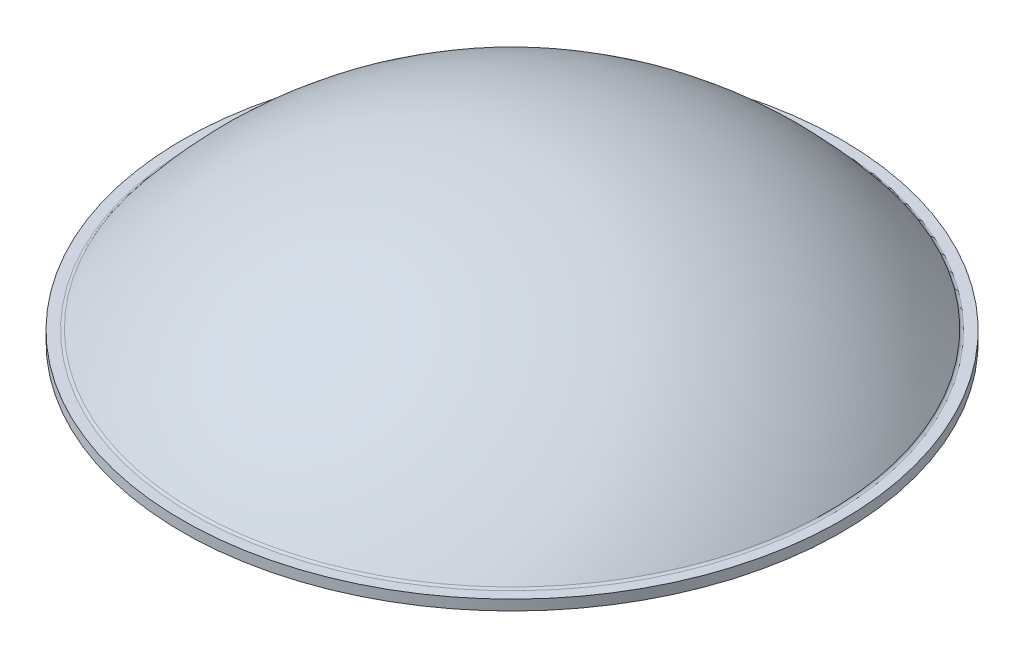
from build123d import *


with BuildPart() as part:
    # Sketch2 → Revolve1 (revolve)
    with BuildSketch(Plane(origin=(0, 0, 0), x_dir=(0, 0, -1), z_dir=(1, 0, 0)), mode=Mode.PRIVATE) as revolve1_sk:
        with BuildLine():
            Line((-3.175, 0), (-3.175, 0.09921875))
            Line((-3.175, 0.09921875), (-3.07578125, 0.09921875))
            ThreePointArc((-3.07578125, 0.09921875), (-3.06137598, 0.102520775), (-3.049847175, 0.111767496))
            ThreePointArc((-3.049847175, 0.111767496), (-1.694059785, 1.199181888), (0, 1.5875))
            Line((0, 1.5875), (0, 0))
            Line((0, 0), (-3.175, 0))
        make_face()
    revolve(revolve1_sk.sketch.rotate(Axis((0, 0, 0), (0, 1, 0)), 180), axis=Axis((0, 0, 0), (0, 1, 0)))


solid = part.part
